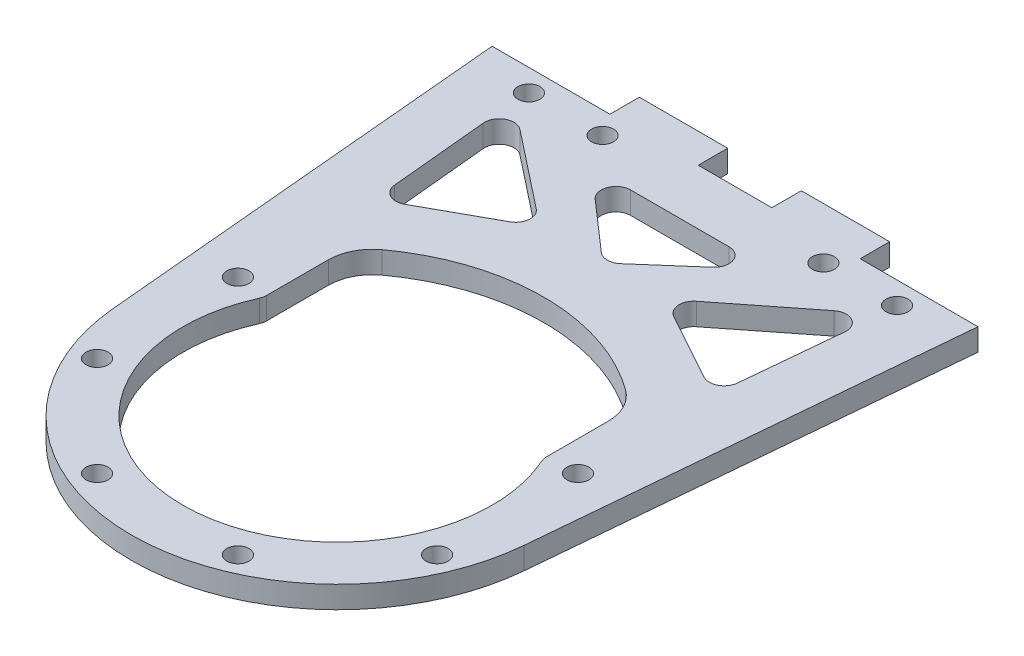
from build123d import *

# Parameters (mm, degrees)
SKETCH1_R           = 28
SKETCH1_R_2         = 13.5
SKETCH1_R_3         = 1.5
BOSS_EXTRUDE1_DEPTH = 3
SKETCH5_R           = 21
CUT_EXTRUDE4_DEPTH  = 10
BOSS_EXTRUDE2_DEPTH = 3
SKETCH7_W           = 12
SKETCH7_H           = 4
BOSS_EXTRUDE3_DEPTH = 3
SKETCH9_R           = 1.5
CUT_EXTRUDE6_DEPTH  = 67.798203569
SKETCH12_R          = 1.5
BOSS_EXTRUDE4_DEPTH = 3
CUT_EXTRUDE7_DEPTH  = 67.798203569
FILLET2_R           = 2
FILLET3_R           = 6


with BuildPart() as part:
    # Sketch1 → Boss-Extrude1 (new body)
    with BuildSketch(Plane(origin=(0, 0, 0), x_dir=(1, 0, 0), z_dir=(0, 1, 0))):
        with Locations(Location((0, 0, 0), (0, 0, 270))):
            Circle(SKETCH1_R)
        with Locations(Location((0, 0, 0), (0, 0, 270))):
            Circle(SKETCH1_R_2, mode=Mode.SUBTRACT)
        with Locations(Location((0, -17.5, 0), (0, 0, 270))):
            Circle(SKETCH1_R_3, mode=Mode.SUBTRACT)
        with Locations(Location((-17.5, 0, 0), (0, 0, 270))):
            Circle(SKETCH1_R_3, mode=Mode.SUBTRACT)
        with Locations(Location((0, 17.5, 0), (0, 0, 270))):
            Circle(SKETCH1_R_3, mode=Mode.SUBTRACT)
        with Locations(Location((17.5, 0, 0), (0, 0, 270))):
            Circle(SKETCH1_R_3, mode=Mode.SUBTRACT)
        with Locations(Location((-9.567085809, -23.096988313, 0), (0, 0, 270))):
            Circle(SKETCH1_R_3, mode=Mode.SUBTRACT)
        with Locations(Location((-23.096988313, -9.567085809, 0), (0, 0, 270))):
            Circle(SKETCH1_R_3, mode=Mode.SUBTRACT)
        with Locations(Location((-23.096988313, 9.567085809, 0), (0, 0, 270))):
            Circle(SKETCH1_R_3, mode=Mode.SUBTRACT)
        with Locations(Location((-9.567085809, 23.096988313, 0), (0, 0, 270))):
            Circle(SKETCH1_R_3, mode=Mode.SUBTRACT)
        with Locations(Location((9.567085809, 23.096988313, 0), (0, 0, 270))):
            Circle(SKETCH1_R_3, mode=Mode.SUBTRACT)
        with Locations(Location((23.096988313, 9.567085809, 0), (0, 0, 270))):
            Circle(SKETCH1_R_3, mode=Mode.SUBTRACT)
        with Locations(Location((23.096988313, -9.567085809, 0), (0, 0, 270))):
            Circle(SKETCH1_R_3, mode=Mode.SUBTRACT)
        with Locations(Location((9.567085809, -23.096988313, 0), (0, 0, 270))):
            Circle(SKETCH1_R_3, mode=Mode.SUBTRACT)
    extrude(amount=BOSS_EXTRUDE1_DEPTH)

    # Sketch5 → Cut-Extrude4 (cut)
    with BuildSketch(Plane.XZ):
        with Locations(Location((0, 0, 0), (0, 0, 270))):
            Circle(SKETCH5_R)
    extrude(amount=-CUT_EXTRUDE4_DEPTH, mode=Mode.SUBTRACT)

    # Sketch6 → Boss-Extrude2 (add, through all)
    with BuildSketch(Plane(origin=(0, 3, 0), x_dir=(1, 0, 0), z_dir=(0, 1, 0))):
        with BuildLine():
            ThreePointArc((-27.886099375, -2.522986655), (-20.671763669, 18.885925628), (0, 28))
            Line((0, 28), (0, 54))
            Line((0, 54), (-33, 54))
            Line((-33, 54), (-27.886099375, -2.522986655))
        make_face()
        with BuildLine():
            Line((0, 54), (0, 28))
            ThreePointArc((0, 28), (19.798989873, 19.798989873), (28, 0))
            ThreePointArc((28, 0), (27.97151035, -1.262778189), (27.886099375, -2.522986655))
            Line((27.886099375, -2.522986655), (33, 54))
            Line((33, 54), (0, 54))
        make_face()
    extrude(amount=-BOSS_EXTRUDE2_DEPTH)

    # Sketch7 → Boss-Extrude3 (add, through all)
    with BuildSketch(Plane(origin=(0, 3, 0), x_dir=(1, 0, 0), z_dir=(0, 1, 0))):
        with Locations((-11, 56)):
            Rectangle(SKETCH7_W, SKETCH7_H)
        with Locations((11, 56)):
            Rectangle(SKETCH7_W, SKETCH7_H)
    extrude(amount=-BOSS_EXTRUDE3_DEPTH)

    # Sketch9 → Cut-Extrude6 (cut, through all)
    with BuildSketch(Plane(origin=(0, 3, 0), x_dir=(1, 0, 0), z_dir=(0, 1, 0))):
        with Locations(Location((-25, 51, 0), (0, 0, 270))):
            Circle(SKETCH9_R)
        with Locations(Location((-15, 51, 0), (0, 0, 270))):
            Circle(SKETCH9_R)
        with Locations(Location((25, 51, 0), (0, 0, 270))):
            Circle(SKETCH9_R)
        with Locations(Location((15, 51, 0), (0, 0, 270))):
            Circle(SKETCH9_R)
    extrude(amount=-CUT_EXTRUDE6_DEPTH, mode=Mode.SUBTRACT)

    # Sketch12 → Boss-Extrude4 (add, through all)
    with BuildSketch(Plane(origin=(0, 3, 0), x_dir=(1, 0, 0), z_dir=(0, 1, 0))):
        with Locations((9.567085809, 23.096988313)):
            Circle(SKETCH12_R)
        with Locations((-9.567085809, 23.096988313)):
            Circle(SKETCH12_R)
    extrude(amount=-BOSS_EXTRUDE4_DEPTH)

    # Sketch11 → Cut-Extrude7 (cut, through all)
    with BuildSketch(Plane(origin=(0, 3, 0), x_dir=(1, 0, 0), z_dir=(0, 1, 0))):
        Polygon((25, 49), (8.5, 36), (23, 28), align=None)
        Polygon((-23, 28), (-8.5, 36), (-25, 49), align=None)
        Polygon((12, 46.5), (-12, 46.5), (0, 36), align=None)
        with BuildLine():
            Line((19, 8.94427191), (19, 20.566963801))
            ThreePointArc((19, 20.566963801), (0, 28), (-19, 20.566963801))
            Line((-19, 20.566963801), (-19, 8.94427191))
            ThreePointArc((-19, 8.94427191), (0, 21), (19, 8.94427191))
        make_face()
    extrude(amount=-CUT_EXTRUDE7_DEPTH, mode=Mode.SUBTRACT)

    # Fillet2
    fillet2_edges = [part.edges().sort_by_distance(p)[0] for p in [
        (-23, 1.5, -28),
        (-25, 1.5, -49),
        (-8.5, 1.5, -36),
        (8.5, 1.5, -36),
        (25, 1.5, -49),
        (23, 1.5, -28),
        (19, 1.5, -8.94427191),
        (-19, 1.5, -8.94427191),
        (0, 1.5, -36),
        (-12, 1.5, -46.5),
        (12, 1.5, -46.5),
    ]]
    fillet(fillet2_edges, radius=FILLET2_R)

    # Fillet3
    fillet3_edges = [part.edges().sort_by_distance(p)[0] for p in [
        (19, 1.5, -20.566963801),
        (-19, 1.5, -20.566963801),
    ]]
    fillet(fillet3_edges, radius=FILLET3_R)


solid = part.part
